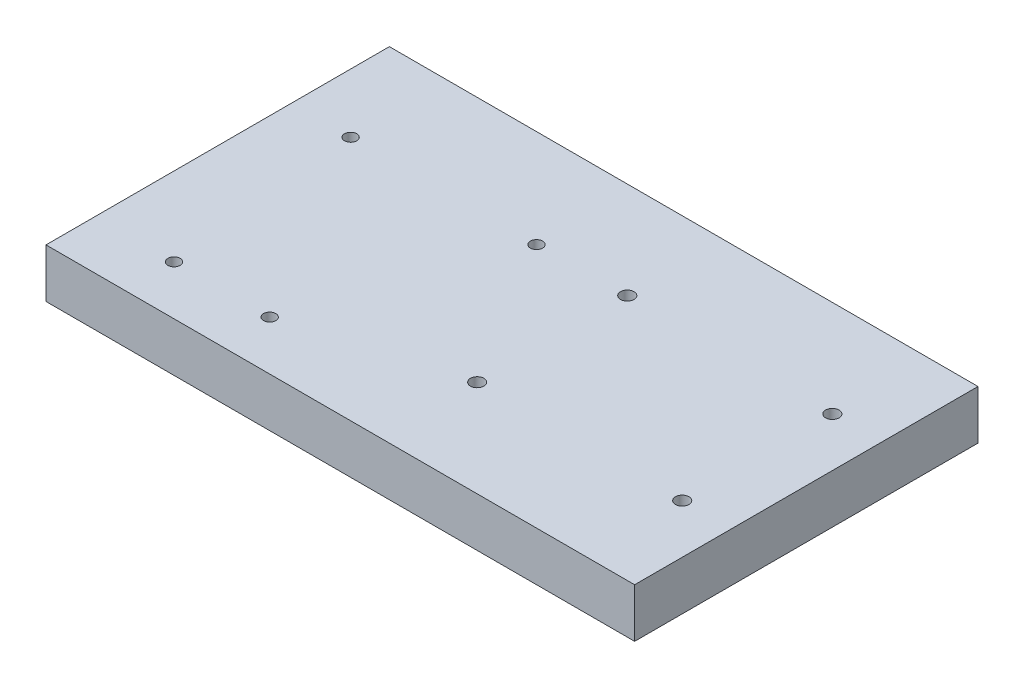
from build123d import *

# Parameters (mm, degrees)
SKETCH1_W             = 152.4
SKETCH1_H             = 88.9
BOSS_EXTRUDE1_DEPTH   = 12.7
F_6_32_TAPPED_HOLE1_D = 3.5052
SKETCH4_R             = 1.5875
CUT_EXTRUDE1_DEPTH    = 90.126497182


with BuildPart() as part:
    # Sketch1 → Boss-Extrude1 (new body)
    with BuildSketch(Plane(origin=(0, 0, 0), x_dir=(1, 0, 0), z_dir=(0, 1, 0))):
        Rectangle(SKETCH1_W, SKETCH1_H)
    extrude(amount=BOSS_EXTRUDE1_DEPTH)

    # 6-32 Tapped Hole1 (through all)
    with Locations(Plane(origin=(63.5, 12.7, -19.431), x_dir=(0, 0, 1), z_dir=(0, 1, 0))):
        with Locations((0, 0), (38.862, 0), (0, -53.086), (38.862, -53.086)):
            Hole(F_6_32_TAPPED_HOLE1_D / 2)

    # Sketch4 → Cut-Extrude1 (cut, through all)
    with BuildSketch(Plane(origin=(0, 12.7, 0), x_dir=(1, 0, 0), z_dir=(0, 1, 0))):
        with Locations(Location((-12.7635, 19.1135, 0), (0, 0, 270))):
            Circle(SKETCH4_R)
        with Locations(Location((-60.8965, 19.1135, 0), (0, 0, 270))):
            Circle(SKETCH4_R)
        with Locations(Location((-31.0515, -31.6865, 0), (0, 0, 90))):
            Circle(SKETCH4_R)
        with Locations(Location((-55.8165, -31.6865, 0), (0, 0, 90))):
            Circle(SKETCH4_R)
    extrude(amount=-CUT_EXTRUDE1_DEPTH, mode=Mode.SUBTRACT)


solid = part.part
